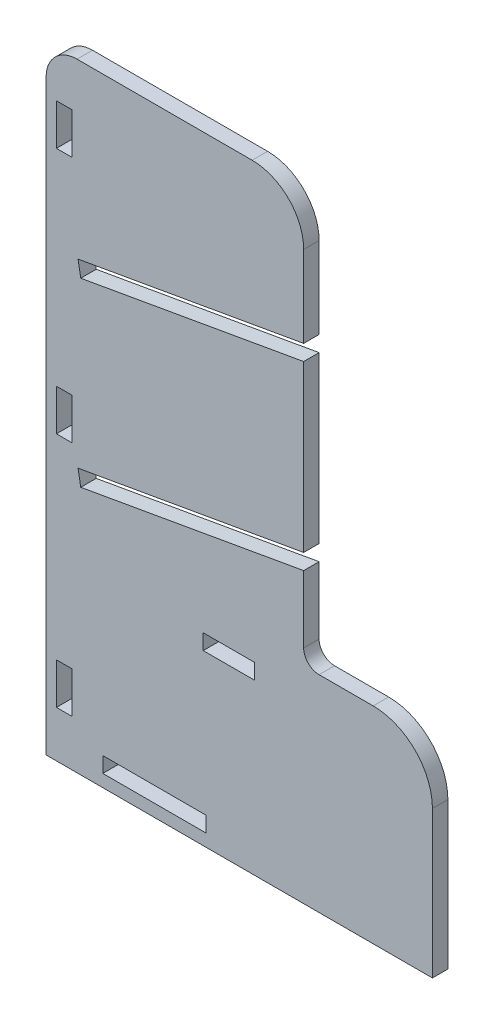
ISO-10303-21;
HEADER;
FILE_DESCRIPTION(('STEP AP214'),'2;1');
FILE_NAME('part.step','',(''),(''),'','','');
FILE_SCHEMA(('AUTOMOTIVE_DESIGN { 1 0 10303 214 1 1 1 1 }'));
ENDSEC;
DATA;
#1=APPLICATION_CONTEXT('core data for automotive mechanical design processes');
#2=APPLICATION_PROTOCOL_DEFINITION('international standard','automotive_design',2000,#1);
#3=PRODUCT_CONTEXT('',#1,'mechanical');
#4=PRODUCT('Part','Part','',(#3));
#5=PRODUCT_RELATED_PRODUCT_CATEGORY('part','',(#4));
#6=PRODUCT_DEFINITION_FORMATION('','',#4);
#7=PRODUCT_DEFINITION_CONTEXT('part definition',#1,'design');
#8=PRODUCT_DEFINITION('design','',#6,#7);
#9=PRODUCT_DEFINITION_SHAPE('','',#8);
#10=(LENGTH_UNIT() NAMED_UNIT(*) SI_UNIT(.MILLI.,.METRE.));
#11=(NAMED_UNIT(*) PLANE_ANGLE_UNIT() SI_UNIT($,.RADIAN.));
#12=(NAMED_UNIT(*) SI_UNIT($,.STERADIAN.) SOLID_ANGLE_UNIT());
#13=UNCERTAINTY_MEASURE_WITH_UNIT(LENGTH_MEASURE(1.E-05),#10,'distance_accuracy_value','');
#14=(GEOMETRIC_REPRESENTATION_CONTEXT(3) GLOBAL_UNCERTAINTY_ASSIGNED_CONTEXT((#13)) GLOBAL_UNIT_ASSIGNED_CONTEXT((#10,
#11,#12)) REPRESENTATION_CONTEXT('',''));
#15=CARTESIAN_POINT('',(0.,0.,0.));
#16=DIRECTION('',(0.,0.,1.));
#17=DIRECTION('',(1.,0.,0.));
#18=AXIS2_PLACEMENT_3D('',#15,#16,#17);
#19=CARTESIAN_POINT('',(125.,-85.,15.));
#20=DIRECTION('',(-1.,0.,0.));
#21=DIRECTION('',(0.,0.,1.));
#22=AXIS2_PLACEMENT_3D('',#19,#20,#21);
#23=PLANE('',#22);
#24=DIRECTION('',(0.,1.,0.));
#25=VECTOR('',#24,1.);
#26=CARTESIAN_POINT('',(125.,-85.,0.));
#27=LINE('',#26,#25);
#28=CARTESIAN_POINT('',(125.,-4.76860082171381,0.));
#29=VERTEX_POINT('',#28);
#30=CARTESIAN_POINT('',(125.,155.768600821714,0.));
#31=VERTEX_POINT('',#30);
#32=EDGE_CURVE('E512',#29,#31,#27,.T.);
#33=ORIENTED_EDGE('',*,*,#32,.T.);
#34=DIRECTION('',(0.,0.,1.));
#35=VECTOR('',#34,1.);
#36=CARTESIAN_POINT('',(125.,155.768600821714,-766.));
#37=LINE('',#36,#35);
#38=CARTESIAN_POINT('',(125.,155.768600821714,15.));
#39=VERTEX_POINT('',#38);
#40=EDGE_CURVE('E289',#31,#39,#37,.T.);
#41=ORIENTED_EDGE('',*,*,#40,.T.);
#42=DIRECTION('',(0.,1.,0.));
#43=VECTOR('',#42,1.);
#44=CARTESIAN_POINT('',(125.,-85.,15.));
#45=LINE('',#44,#43);
#46=CARTESIAN_POINT('',(125.,-4.76860082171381,15.));
#47=VERTEX_POINT('',#46);
#48=EDGE_CURVE('E488',#47,#39,#45,.T.);
#49=ORIENTED_EDGE('',*,*,#48,.F.);
#50=DIRECTION('',(0.,0.,1.));
#51=VECTOR('',#50,1.);
#52=CARTESIAN_POINT('',(125.,-4.76860082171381,-766.));
#53=LINE('',#52,#51);
#54=EDGE_CURVE('E283',#29,#47,#53,.T.);
#55=ORIENTED_EDGE('',*,*,#54,.F.);
#56=EDGE_LOOP('',(#33,#41,#49,#55));
#57=FACE_BOUND('',#56,.T.);
#58=ADVANCED_FACE('F37',(#57),#23,.F.);
#59=CARTESIAN_POINT('',(125.,-85.,0.));
#60=VERTEX_POINT('',#59);
#61=CARTESIAN_POINT('',(125.,-20.,0.));
#62=VERTEX_POINT('',#61);
#63=EDGE_CURVE('E508',#60,#62,#27,.T.);
#64=ORIENTED_EDGE('',*,*,#63,.T.);
#65=DIRECTION('',(0.,0.,1.));
#66=VECTOR('',#65,1.);
#67=CARTESIAN_POINT('',(125.,-20.,-766.));
#68=LINE('',#67,#66);
#69=CARTESIAN_POINT('',(125.,-20.,15.));
#70=VERTEX_POINT('',#69);
#71=EDGE_CURVE('E577',#62,#70,#68,.T.);
#72=ORIENTED_EDGE('',*,*,#71,.T.);
#73=CARTESIAN_POINT('',(125.,-85.,15.));
#74=VERTEX_POINT('',#73);
#75=EDGE_CURVE('E485',#74,#70,#45,.T.);
#76=ORIENTED_EDGE('',*,*,#75,.F.);
#77=DIRECTION('',(0.,0.,-1.));
#78=VECTOR('',#77,1.);
#79=CARTESIAN_POINT('',(125.,-85.,15.));
#80=LINE('',#79,#78);
#81=EDGE_CURVE('E533',#74,#60,#80,.T.);
#82=ORIENTED_EDGE('',*,*,#81,.T.);
#83=EDGE_LOOP('',(#64,#72,#76,#82));
#84=FACE_BOUND('',#83,.T.);
#85=ADVANCED_FACE('F581',(#84),#23,.F.);
#86=CARTESIAN_POINT('',(-125.,-300.,15.));
#87=DIRECTION('',(0.,1.,0.));
#88=DIRECTION('',(0.,0.,1.));
#89=AXIS2_PLACEMENT_3D('',#86,#87,#88);
#90=PLANE('',#89);
#91=DIRECTION('',(1.,0.,0.));
#92=VECTOR('',#91,1.);
#93=CARTESIAN_POINT('',(-125.,-300.,0.));
#94=LINE('',#93,#92);
#95=CARTESIAN_POINT('',(-125.,-300.,0.));
#96=VERTEX_POINT('',#95);
#97=CARTESIAN_POINT('',(250.,-300.,0.));
#98=VERTEX_POINT('',#97);
#99=EDGE_CURVE('E411',#96,#98,#94,.T.);
#100=ORIENTED_EDGE('',*,*,#99,.T.);
#101=DIRECTION('',(0.,0.,-1.));
#102=VECTOR('',#101,1.);
#103=CARTESIAN_POINT('',(250.,-300.,15.));
#104=LINE('',#103,#102);
#105=CARTESIAN_POINT('',(250.,-300.,15.));
#106=VERTEX_POINT('',#105);
#107=EDGE_CURVE('E545',#106,#98,#104,.T.);
#108=ORIENTED_EDGE('',*,*,#107,.F.);
#109=DIRECTION('',(1.,0.,0.));
#110=VECTOR('',#109,1.);
#111=CARTESIAN_POINT('',(-125.,-300.,15.));
#112=LINE('',#111,#110);
#113=CARTESIAN_POINT('',(-125.,-300.,15.));
#114=VERTEX_POINT('',#113);
#115=EDGE_CURVE('E472',#114,#106,#112,.T.);
#116=ORIENTED_EDGE('',*,*,#115,.F.);
#117=DIRECTION('',(0.,0.,-1.));
#118=VECTOR('',#117,1.);
#119=CARTESIAN_POINT('',(-125.,-300.,15.));
#120=LINE('',#119,#118);
#121=EDGE_CURVE('E496',#114,#96,#120,.T.);
#122=ORIENTED_EDGE('',*,*,#121,.T.);
#123=EDGE_LOOP('',(#100,#108,#116,#122));
#124=FACE_BOUND('',#123,.T.);
#125=ADVANCED_FACE('F39',(#124),#90,.F.);
#126=CARTESIAN_POINT('',(250.,-300.,15.));
#127=DIRECTION('',(-1.,0.,0.));
#128=DIRECTION('',(0.,-1.,0.));
#129=AXIS2_PLACEMENT_3D('',#126,#127,#128);
#130=PLANE('',#129);
#131=DIRECTION('',(0.,1.,0.));
#132=VECTOR('',#131,1.);
#133=CARTESIAN_POINT('',(250.,-300.,0.));
#134=LINE('',#133,#132);
#135=CARTESIAN_POINT('',(250.,-157.5,0.));
#136=VERTEX_POINT('',#135);
#137=EDGE_CURVE('E499',#98,#136,#134,.T.);
#138=ORIENTED_EDGE('',*,*,#137,.T.);
#139=DIRECTION('',(0.,0.,-1.));
#140=VECTOR('',#139,1.);
#141=CARTESIAN_POINT('',(250.,-157.5,15.));
#142=LINE('',#141,#140);
#143=CARTESIAN_POINT('',(250.,-157.5,15.));
#144=VERTEX_POINT('',#143);
#145=EDGE_CURVE('E542',#144,#136,#142,.T.);
#146=ORIENTED_EDGE('',*,*,#145,.F.);
#147=DIRECTION('',(0.,1.,0.));
#148=VECTOR('',#147,1.);
#149=CARTESIAN_POINT('',(250.,-300.,15.));
#150=LINE('',#149,#148);
#151=EDGE_CURVE('E475',#106,#144,#150,.T.);
#152=ORIENTED_EDGE('',*,*,#151,.F.);
#153=ORIENTED_EDGE('',*,*,#107,.T.);
#154=EDGE_LOOP('',(#138,#146,#152,#153));
#155=FACE_BOUND('',#154,.T.);
#156=ADVANCED_FACE('F987',(#155),#130,.F.);
#157=CARTESIAN_POINT('',(192.5,-157.5,15.));
#158=DIRECTION('',(0.,0.,-1.));
#159=DIRECTION('',(-1.,0.,0.));
#160=AXIS2_PLACEMENT_3D('',#157,#158,#159);
#161=CYLINDRICAL_SURFACE('',#160,57.5);
#162=CARTESIAN_POINT('',(192.5,-157.5,0.));
#163=DIRECTION('',(0.,0.,1.));
#164=DIRECTION('',(1.,0.,0.));
#165=AXIS2_PLACEMENT_3D('',#162,#163,#164);
#166=CIRCLE('',#165,57.5);
#167=CARTESIAN_POINT('',(192.5,-100.,0.));
#168=VERTEX_POINT('',#167);
#169=EDGE_CURVE('E501',#136,#168,#166,.T.);
#170=ORIENTED_EDGE('',*,*,#169,.T.);
#171=DIRECTION('',(0.,0.,-1.));
#172=VECTOR('',#171,1.);
#173=CARTESIAN_POINT('',(192.5,-100.,15.));
#174=LINE('',#173,#172);
#175=CARTESIAN_POINT('',(192.5,-100.,15.));
#176=VERTEX_POINT('',#175);
#177=EDGE_CURVE('E539',#176,#168,#174,.T.);
#178=ORIENTED_EDGE('',*,*,#177,.F.);
#179=CARTESIAN_POINT('',(192.5,-157.5,15.));
#180=DIRECTION('',(0.,0.,1.));
#181=DIRECTION('',(1.,0.,0.));
#182=AXIS2_PLACEMENT_3D('',#179,#180,#181);
#183=CIRCLE('',#182,57.5);
#184=EDGE_CURVE('E478',#144,#176,#183,.T.);
#185=ORIENTED_EDGE('',*,*,#184,.F.);
#186=ORIENTED_EDGE('',*,*,#145,.T.);
#187=EDGE_LOOP('',(#170,#178,#185,#186));
#188=FACE_BOUND('',#187,.T.);
#189=ADVANCED_FACE('F976',(#188),#161,.T.);
#190=CARTESIAN_POINT('',(192.5,-100.,15.));
#191=DIRECTION('',(0.,-1.,0.));
#192=DIRECTION('',(1.,0.,0.));
#193=AXIS2_PLACEMENT_3D('',#190,#191,#192);
#194=PLANE('',#193);
#195=DIRECTION('',(-1.,0.,0.));
#196=VECTOR('',#195,1.);
#197=CARTESIAN_POINT('',(192.5,-100.,0.));
#198=LINE('',#197,#196);
#199=CARTESIAN_POINT('',(140.,-100.,0.));
#200=VERTEX_POINT('',#199);
#201=EDGE_CURVE('E503',#168,#200,#198,.T.);
#202=ORIENTED_EDGE('',*,*,#201,.T.);
#203=DIRECTION('',(0.,0.,-1.));
#204=VECTOR('',#203,1.);
#205=CARTESIAN_POINT('',(140.,-100.,15.));
#206=LINE('',#205,#204);
#207=CARTESIAN_POINT('',(140.,-100.,15.));
#208=VERTEX_POINT('',#207);
#209=EDGE_CURVE('E536',#208,#200,#206,.T.);
#210=ORIENTED_EDGE('',*,*,#209,.F.);
#211=DIRECTION('',(-1.,0.,0.));
#212=VECTOR('',#211,1.);
#213=CARTESIAN_POINT('',(192.5,-100.,15.));
#214=LINE('',#213,#212);
#215=EDGE_CURVE('E480',#176,#208,#214,.T.);
#216=ORIENTED_EDGE('',*,*,#215,.F.);
#217=ORIENTED_EDGE('',*,*,#177,.T.);
#218=EDGE_LOOP('',(#202,#210,#216,#217));
#219=FACE_BOUND('',#218,.T.);
#220=ADVANCED_FACE('F623',(#219),#194,.F.);
#221=CARTESIAN_POINT('',(140.,-85.,15.));
#222=DIRECTION('',(0.,0.,-1.));
#223=DIRECTION('',(-1.,0.,0.));
#224=AXIS2_PLACEMENT_3D('',#221,#222,#223);
#225=CYLINDRICAL_SURFACE('',#224,15.);
#226=CARTESIAN_POINT('',(140.,-85.,0.));
#227=DIRECTION('',(0.,0.,-1.));
#228=DIRECTION('',(1.,0.,0.));
#229=AXIS2_PLACEMENT_3D('',#226,#227,#228);
#230=CIRCLE('',#229,15.);
#231=EDGE_CURVE('E505',#200,#60,#230,.T.);
#232=ORIENTED_EDGE('',*,*,#231,.T.);
#233=ORIENTED_EDGE('',*,*,#81,.F.);
#234=CARTESIAN_POINT('',(140.,-85.,15.));
#235=DIRECTION('',(0.,0.,-1.));
#236=DIRECTION('',(1.,0.,0.));
#237=AXIS2_PLACEMENT_3D('',#234,#235,#236);
#238=CIRCLE('',#237,15.);
#239=EDGE_CURVE('E482',#208,#74,#238,.T.);
#240=ORIENTED_EDGE('',*,*,#239,.F.);
#241=ORIENTED_EDGE('',*,*,#209,.T.);
#242=EDGE_LOOP('',(#232,#233,#240,#241));
#243=FACE_BOUND('',#242,.T.);
#244=ADVANCED_FACE('F589',(#243),#225,.F.);
#245=CARTESIAN_POINT('',(125.,171.,15.));
#246=VERTEX_POINT('',#245);
#247=CARTESIAN_POINT('',(125.,250.,15.));
#248=VERTEX_POINT('',#247);
#249=EDGE_CURVE('E484',#246,#248,#45,.T.);
#250=ORIENTED_EDGE('',*,*,#249,.F.);
#251=DIRECTION('',(0.,0.,1.));
#252=VECTOR('',#251,1.);
#253=CARTESIAN_POINT('',(125.,171.,-766.));
#254=LINE('',#253,#252);
#255=CARTESIAN_POINT('',(125.,171.,0.));
#256=VERTEX_POINT('',#255);
#257=EDGE_CURVE('E572',#256,#246,#254,.T.);
#258=ORIENTED_EDGE('',*,*,#257,.F.);
#259=CARTESIAN_POINT('',(125.,250.,0.));
#260=VERTEX_POINT('',#259);
#261=EDGE_CURVE('E507',#256,#260,#27,.T.);
#262=ORIENTED_EDGE('',*,*,#261,.T.);
#263=DIRECTION('',(0.,0.,-1.));
#264=VECTOR('',#263,1.);
#265=CARTESIAN_POINT('',(125.,250.,15.));
#266=LINE('',#265,#264);
#267=EDGE_CURVE('E530',#248,#260,#266,.T.);
#268=ORIENTED_EDGE('',*,*,#267,.F.);
#269=EDGE_LOOP('',(#250,#258,#262,#268));
#270=FACE_BOUND('',#269,.T.);
#271=ADVANCED_FACE('F608',(#270),#23,.F.);
#272=CARTESIAN_POINT('',(75.,250.,15.));
#273=DIRECTION('',(0.,0.,-1.));
#274=DIRECTION('',(-1.,0.,0.));
#275=AXIS2_PLACEMENT_3D('',#272,#273,#274);
#276=CYLINDRICAL_SURFACE('',#275,50.);
#277=CARTESIAN_POINT('',(75.,250.,0.));
#278=DIRECTION('',(0.,0.,1.));
#279=DIRECTION('',(1.,0.,0.));
#280=AXIS2_PLACEMENT_3D('',#277,#278,#279);
#281=CIRCLE('',#280,50.);
#282=CARTESIAN_POINT('',(75.,300.,0.));
#283=VERTEX_POINT('',#282);
#284=EDGE_CURVE('E511',#260,#283,#281,.T.);
#285=ORIENTED_EDGE('',*,*,#284,.T.);
#286=DIRECTION('',(0.,0.,-1.));
#287=VECTOR('',#286,1.);
#288=CARTESIAN_POINT('',(75.,300.,15.));
#289=LINE('',#288,#287);
#290=CARTESIAN_POINT('',(75.,300.,15.));
#291=VERTEX_POINT('',#290);
#292=EDGE_CURVE('E527',#291,#283,#289,.T.);
#293=ORIENTED_EDGE('',*,*,#292,.F.);
#294=CARTESIAN_POINT('',(75.,250.,15.));
#295=DIRECTION('',(0.,0.,1.));
#296=DIRECTION('',(1.,0.,0.));
#297=AXIS2_PLACEMENT_3D('',#294,#295,#296);
#298=CIRCLE('',#297,50.);
#299=EDGE_CURVE('E487',#248,#291,#298,.T.);
#300=ORIENTED_EDGE('',*,*,#299,.F.);
#301=ORIENTED_EDGE('',*,*,#267,.T.);
#302=EDGE_LOOP('',(#285,#293,#300,#301));
#303=FACE_BOUND('',#302,.T.);
#304=ADVANCED_FACE('F615',(#303),#276,.T.);
#305=CARTESIAN_POINT('',(75.,300.,15.));
#306=DIRECTION('',(0.,-1.,0.));
#307=DIRECTION('',(1.,0.,0.));
#308=AXIS2_PLACEMENT_3D('',#305,#306,#307);
#309=PLANE('',#308);
#310=DIRECTION('',(-1.,0.,0.));
#311=VECTOR('',#310,1.);
#312=CARTESIAN_POINT('',(75.,300.,0.));
#313=LINE('',#312,#311);
#314=CARTESIAN_POINT('',(-95.,300.,0.));
#315=VERTEX_POINT('',#314);
#316=EDGE_CURVE('E514',#283,#315,#313,.T.);
#317=ORIENTED_EDGE('',*,*,#316,.T.);
#318=DIRECTION('',(0.,0.,-1.));
#319=VECTOR('',#318,1.);
#320=CARTESIAN_POINT('',(-95.,300.,15.));
#321=LINE('',#320,#319);
#322=CARTESIAN_POINT('',(-95.,300.,15.));
#323=VERTEX_POINT('',#322);
#324=EDGE_CURVE('E524',#323,#315,#321,.T.);
#325=ORIENTED_EDGE('',*,*,#324,.F.);
#326=DIRECTION('',(-1.,0.,0.));
#327=VECTOR('',#326,1.);
#328=CARTESIAN_POINT('',(75.,300.,15.));
#329=LINE('',#328,#327);
#330=EDGE_CURVE('E490',#291,#323,#329,.T.);
#331=ORIENTED_EDGE('',*,*,#330,.F.);
#332=ORIENTED_EDGE('',*,*,#292,.T.);
#333=EDGE_LOOP('',(#317,#325,#331,#332));
#334=FACE_BOUND('',#333,.T.);
#335=ADVANCED_FACE('F621',(#334),#309,.F.);
#336=CARTESIAN_POINT('',(-95.,270.,15.));
#337=DIRECTION('',(0.,0.,-1.));
#338=DIRECTION('',(-1.,0.,0.));
#339=AXIS2_PLACEMENT_3D('',#336,#337,#338);
#340=CYLINDRICAL_SURFACE('',#339,30.);
#341=CARTESIAN_POINT('',(-95.,270.,0.));
#342=DIRECTION('',(0.,0.,1.));
#343=DIRECTION('',(-1.,0.,0.));
#344=AXIS2_PLACEMENT_3D('',#341,#342,#343);
#345=CIRCLE('',#344,30.);
#346=CARTESIAN_POINT('',(-125.,270.,0.));
#347=VERTEX_POINT('',#346);
#348=EDGE_CURVE('E516',#315,#347,#345,.T.);
#349=ORIENTED_EDGE('',*,*,#348,.T.);
#350=DIRECTION('',(0.,0.,-1.));
#351=VECTOR('',#350,1.);
#352=CARTESIAN_POINT('',(-125.,270.,15.));
#353=LINE('',#352,#351);
#354=CARTESIAN_POINT('',(-125.,270.,15.));
#355=VERTEX_POINT('',#354);
#356=EDGE_CURVE('E521',#355,#347,#353,.T.);
#357=ORIENTED_EDGE('',*,*,#356,.F.);
#358=CARTESIAN_POINT('',(-95.,270.,15.));
#359=DIRECTION('',(0.,0.,1.));
#360=DIRECTION('',(-1.,0.,0.));
#361=AXIS2_PLACEMENT_3D('',#358,#359,#360);
#362=CIRCLE('',#361,30.);
#363=EDGE_CURVE('E492',#323,#355,#362,.T.);
#364=ORIENTED_EDGE('',*,*,#363,.F.);
#365=ORIENTED_EDGE('',*,*,#324,.T.);
#366=EDGE_LOOP('',(#349,#357,#364,#365));
#367=FACE_BOUND('',#366,.T.);
#368=ADVANCED_FACE('F933',(#367),#340,.T.);
#369=CARTESIAN_POINT('',(-125.,270.,15.));
#370=DIRECTION('',(1.,0.,0.));
#371=DIRECTION('',(0.,1.,0.));
#372=AXIS2_PLACEMENT_3D('',#369,#370,#371);
#373=PLANE('',#372);
#374=DIRECTION('',(0.,-1.,0.));
#375=VECTOR('',#374,1.);
#376=CARTESIAN_POINT('',(-125.,270.,0.));
#377=LINE('',#376,#375);
#378=EDGE_CURVE('E476',#347,#96,#377,.T.);
#379=ORIENTED_EDGE('',*,*,#378,.T.);
#380=ORIENTED_EDGE('',*,*,#121,.F.);
#381=DIRECTION('',(0.,-1.,0.));
#382=VECTOR('',#381,1.);
#383=CARTESIAN_POINT('',(-125.,270.,15.));
#384=LINE('',#383,#382);
#385=EDGE_CURVE('E494',#355,#114,#384,.T.);
#386=ORIENTED_EDGE('',*,*,#385,.F.);
#387=ORIENTED_EDGE('',*,*,#356,.T.);
#388=EDGE_LOOP('',(#379,#380,#386,#387));
#389=FACE_BOUND('',#388,.T.);
#390=ADVANCED_FACE('F694',(#389),#373,.F.);
#391=CARTESIAN_POINT('',(192.5,-157.5,15.));
#392=DIRECTION('',(0.,0.,1.));
#393=DIRECTION('',(1.,0.,0.));
#394=AXIS2_PLACEMENT_3D('',#391,#392,#393);
#395=PLANE('',#394);
#396=DIRECTION('',(0.984807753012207,0.173648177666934,0.));
#397=VECTOR('',#396,1.);
#398=CARTESIAN_POINT('',(136.892540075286,157.865576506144,15.));
#399=LINE('',#398,#397);
#400=CARTESIAN_POINT('',(-91.395277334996,117.612274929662,15.));
#401=VERTEX_POINT('',#400);
#402=EDGE_CURVE('E314',#401,#39,#399,.T.);
#403=ORIENTED_EDGE('',*,*,#402,.F.);
#404=DIRECTION('',(0.173648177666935,-0.984807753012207,0.));
#405=VECTOR('',#404,1.);
#406=CARTESIAN_POINT('',(-35.7878174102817,-197.753301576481,15.));
#407=LINE('',#406,#405);
#408=CARTESIAN_POINT('',(-94.,132.384391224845,15.));
#409=VERTEX_POINT('',#408);
#410=EDGE_CURVE('E312',#409,#401,#407,.T.);
#411=ORIENTED_EDGE('',*,*,#410,.F.);
#412=DIRECTION('',(-0.984807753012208,-0.173648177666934,0.));
#413=VECTOR('',#412,1.);
#414=CARTESIAN_POINT('',(134.287817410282,172.637692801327,15.));
#415=LINE('',#414,#413);
#416=EDGE_CURVE('E307',#246,#409,#415,.T.);
#417=ORIENTED_EDGE('',*,*,#416,.F.);
#418=ORIENTED_EDGE('',*,*,#249,.T.);
#419=ORIENTED_EDGE('',*,*,#299,.T.);
#420=ORIENTED_EDGE('',*,*,#330,.T.);
#421=ORIENTED_EDGE('',*,*,#363,.T.);
#422=ORIENTED_EDGE('',*,*,#385,.T.);
#423=ORIENTED_EDGE('',*,*,#115,.T.);
#424=ORIENTED_EDGE('',*,*,#151,.T.);
#425=ORIENTED_EDGE('',*,*,#184,.T.);
#426=ORIENTED_EDGE('',*,*,#215,.T.);
#427=ORIENTED_EDGE('',*,*,#239,.T.);
#428=ORIENTED_EDGE('',*,*,#75,.T.);
#429=DIRECTION('',(0.984807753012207,0.173648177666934,0.));
#430=VECTOR('',#429,1.);
#431=CARTESIAN_POINT('',(166.950741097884,-12.6029524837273,15.));
#432=LINE('',#431,#430);
#433=CARTESIAN_POINT('',(-91.395277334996,-58.1563258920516,15.));
#434=VERTEX_POINT('',#433);
#435=EDGE_CURVE('E305',#434,#70,#432,.T.);
#436=ORIENTED_EDGE('',*,*,#435,.F.);
#437=DIRECTION('',(0.173648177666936,-0.984807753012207,0.));
#438=VECTOR('',#437,1.);
#439=CARTESIAN_POINT('',(-65.8460184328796,-203.053373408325,15.));
#440=LINE('',#439,#438);
#441=CARTESIAN_POINT('',(-94.,-43.3842095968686,15.));
#442=VERTEX_POINT('',#441);
#443=EDGE_CURVE('E288',#442,#434,#440,.T.);
#444=ORIENTED_EDGE('',*,*,#443,.F.);
#445=DIRECTION('',(-0.984807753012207,-0.173648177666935,0.));
#446=VECTOR('',#445,1.);
#447=CARTESIAN_POINT('',(164.34601843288,2.16916381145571,15.));
#448=LINE('',#447,#446);
#449=EDGE_CURVE('E280',#47,#442,#448,.T.);
#450=ORIENTED_EDGE('',*,*,#449,.F.);
#451=ORIENTED_EDGE('',*,*,#48,.T.);
#452=EDGE_LOOP('',(#403,#411,#417,#418,#419,#420,#421,#422,#423,#424,#425,#426,#427,#428,#436,
#444,#450,#451));
#453=FACE_BOUND('',#452,.T.);
#454=DIRECTION('',(0.,-1.,0.));
#455=VECTOR('',#454,1.);
#456=CARTESIAN_POINT('',(-70.,-273.,15.));
#457=LINE('',#456,#455);
#458=CARTESIAN_POINT('',(-70.,-273.,15.));
#459=VERTEX_POINT('',#458);
#460=CARTESIAN_POINT('',(-70.,-288.,15.));
#461=VERTEX_POINT('',#460);
#462=EDGE_CURVE('E324',#459,#461,#457,.T.);
#463=ORIENTED_EDGE('',*,*,#462,.F.);
#464=DIRECTION('',(-1.,0.,0.));
#465=VECTOR('',#464,1.);
#466=CARTESIAN_POINT('',(-70.,-273.,15.));
#467=LINE('',#466,#465);
#468=CARTESIAN_POINT('',(30.,-273.,15.));
#469=VERTEX_POINT('',#468);
#470=EDGE_CURVE('E332',#469,#459,#467,.T.);
#471=ORIENTED_EDGE('',*,*,#470,.F.);
#472=DIRECTION('',(0.,1.,0.));
#473=VECTOR('',#472,1.);
#474=CARTESIAN_POINT('',(30.,-273.,15.));
#475=LINE('',#474,#473);
#476=CARTESIAN_POINT('',(30.,-288.,15.));
#477=VERTEX_POINT('',#476);
#478=EDGE_CURVE('E329',#477,#469,#475,.T.);
#479=ORIENTED_EDGE('',*,*,#478,.F.);
#480=DIRECTION('',(1.,0.,0.));
#481=VECTOR('',#480,1.);
#482=CARTESIAN_POINT('',(-70.,-288.,15.));
#483=LINE('',#482,#481);
#484=EDGE_CURVE('E326',#461,#477,#483,.T.);
#485=ORIENTED_EDGE('',*,*,#484,.F.);
#486=EDGE_LOOP('',(#463,#471,#479,#485));
#487=FACE_BOUND('',#486,.T.);
#488=DIRECTION('',(0.,-1.,0.));
#489=VECTOR('',#488,1.);
#490=CARTESIAN_POINT('',(27.5,-121.,15.));
#491=LINE('',#490,#489);
#492=CARTESIAN_POINT('',(27.5,-121.,15.));
#493=VERTEX_POINT('',#492);
#494=CARTESIAN_POINT('',(27.5,-136.,15.));
#495=VERTEX_POINT('',#494);
#496=EDGE_CURVE('E355',#493,#495,#491,.T.);
#497=ORIENTED_EDGE('',*,*,#496,.F.);
#498=DIRECTION('',(-1.,0.,0.));
#499=VECTOR('',#498,1.);
#500=CARTESIAN_POINT('',(27.5,-121.,15.));
#501=LINE('',#500,#499);
#502=CARTESIAN_POINT('',(77.5,-121.,15.));
#503=VERTEX_POINT('',#502);
#504=EDGE_CURVE('E363',#503,#493,#501,.T.);
#505=ORIENTED_EDGE('',*,*,#504,.F.);
#506=DIRECTION('',(0.,1.,0.));
#507=VECTOR('',#506,1.);
#508=CARTESIAN_POINT('',(77.5,-121.,15.));
#509=LINE('',#508,#507);
#510=CARTESIAN_POINT('',(77.5,-136.,15.));
#511=VERTEX_POINT('',#510);
#512=EDGE_CURVE('E360',#511,#503,#509,.T.);
#513=ORIENTED_EDGE('',*,*,#512,.F.);
#514=DIRECTION('',(1.,0.,0.));
#515=VECTOR('',#514,1.);
#516=CARTESIAN_POINT('',(27.5,-136.,15.));
#517=LINE('',#516,#515);
#518=EDGE_CURVE('E357',#495,#511,#517,.T.);
#519=ORIENTED_EDGE('',*,*,#518,.F.);
#520=EDGE_LOOP('',(#497,#505,#513,#519));
#521=FACE_BOUND('',#520,.T.);
#522=DIRECTION('',(0.,-1.,0.));
#523=VECTOR('',#522,1.);
#524=CARTESIAN_POINT('',(-115.,255.,15.));
#525=LINE('',#524,#523);
#526=CARTESIAN_POINT('',(-115.,255.,15.));
#527=VERTEX_POINT('',#526);
#528=CARTESIAN_POINT('',(-115.,215.,15.));
#529=VERTEX_POINT('',#528);
#530=EDGE_CURVE('E388',#527,#529,#525,.T.);
#531=ORIENTED_EDGE('',*,*,#530,.F.);
#532=DIRECTION('',(-1.,0.,0.));
#533=VECTOR('',#532,1.);
#534=CARTESIAN_POINT('',(-115.,255.,15.));
#535=LINE('',#534,#533);
#536=CARTESIAN_POINT('',(-100.,255.,15.));
#537=VERTEX_POINT('',#536);
#538=EDGE_CURVE('E396',#537,#527,#535,.T.);
#539=ORIENTED_EDGE('',*,*,#538,.F.);
#540=DIRECTION('',(0.,1.,0.));
#541=VECTOR('',#540,1.);
#542=CARTESIAN_POINT('',(-100.,255.,15.));
#543=LINE('',#542,#541);
#544=CARTESIAN_POINT('',(-100.,215.,15.));
#545=VERTEX_POINT('',#544);
#546=EDGE_CURVE('E393',#545,#537,#543,.T.);
#547=ORIENTED_EDGE('',*,*,#546,.F.);
#548=DIRECTION('',(1.,0.,0.));
#549=VECTOR('',#548,1.);
#550=CARTESIAN_POINT('',(-115.,215.,15.));
#551=LINE('',#550,#549);
#552=EDGE_CURVE('E390',#529,#545,#551,.T.);
#553=ORIENTED_EDGE('',*,*,#552,.F.);
#554=EDGE_LOOP('',(#531,#539,#547,#553));
#555=FACE_BOUND('',#554,.T.);
#556=DIRECTION('',(0.,-1.,0.));
#557=VECTOR('',#556,1.);
#558=CARTESIAN_POINT('',(-115.,-215.,15.));
#559=LINE('',#558,#557);
#560=CARTESIAN_POINT('',(-115.,-215.,15.));
#561=VERTEX_POINT('',#560);
#562=CARTESIAN_POINT('',(-115.,-255.,15.));
#563=VERTEX_POINT('',#562);
#564=EDGE_CURVE('E434',#561,#563,#559,.T.);
#565=ORIENTED_EDGE('',*,*,#564,.F.);
#566=DIRECTION('',(-1.,0.,0.));
#567=VECTOR('',#566,1.);
#568=CARTESIAN_POINT('',(-115.,-215.,15.));
#569=LINE('',#568,#567);
#570=CARTESIAN_POINT('',(-100.,-215.,15.));
#571=VERTEX_POINT('',#570);
#572=EDGE_CURVE('E420',#571,#561,#569,.T.);
#573=ORIENTED_EDGE('',*,*,#572,.F.);
#574=DIRECTION('',(0.,1.,0.));
#575=VECTOR('',#574,1.);
#576=CARTESIAN_POINT('',(-100.,-215.,15.));
#577=LINE('',#576,#575);
#578=CARTESIAN_POINT('',(-100.,-255.,15.));
#579=VERTEX_POINT('',#578);
#580=EDGE_CURVE('E428',#579,#571,#577,.T.);
#581=ORIENTED_EDGE('',*,*,#580,.F.);
#582=DIRECTION('',(1.,0.,0.));
#583=VECTOR('',#582,1.);
#584=CARTESIAN_POINT('',(-115.,-255.,15.));
#585=LINE('',#584,#583);
#586=EDGE_CURVE('E431',#563,#579,#585,.T.);
#587=ORIENTED_EDGE('',*,*,#586,.F.);
#588=EDGE_LOOP('',(#565,#573,#581,#587));
#589=FACE_BOUND('',#588,.T.);
#590=DIRECTION('',(0.,-1.,0.));
#591=VECTOR('',#590,1.);
#592=CARTESIAN_POINT('',(-115.,-25.,15.));
#593=LINE('',#592,#591);
#594=CARTESIAN_POINT('',(-115.,15.,15.));
#595=VERTEX_POINT('',#594);
#596=CARTESIAN_POINT('',(-115.,-25.,15.));
#597=VERTEX_POINT('',#596);
#598=EDGE_CURVE('E463',#595,#597,#593,.T.);
#599=ORIENTED_EDGE('',*,*,#598,.F.);
#600=DIRECTION('',(-1.,0.,0.));
#601=VECTOR('',#600,1.);
#602=CARTESIAN_POINT('',(-115.,15.,15.));
#603=LINE('',#602,#601);
#604=CARTESIAN_POINT('',(-100.,15.,15.));
#605=VERTEX_POINT('',#604);
#606=EDGE_CURVE('E449',#605,#595,#603,.T.);
#607=ORIENTED_EDGE('',*,*,#606,.F.);
#608=DIRECTION('',(0.,1.,0.));
#609=VECTOR('',#608,1.);
#610=CARTESIAN_POINT('',(-100.,-25.,15.));
#611=LINE('',#610,#609);
#612=CARTESIAN_POINT('',(-100.,-25.,15.));
#613=VERTEX_POINT('',#612);
#614=EDGE_CURVE('E457',#613,#605,#611,.T.);
#615=ORIENTED_EDGE('',*,*,#614,.F.);
#616=DIRECTION('',(1.,0.,0.));
#617=VECTOR('',#616,1.);
#618=CARTESIAN_POINT('',(-115.,-25.,15.));
#619=LINE('',#618,#617);
#620=EDGE_CURVE('E460',#597,#613,#619,.T.);
#621=ORIENTED_EDGE('',*,*,#620,.F.);
#622=EDGE_LOOP('',(#599,#607,#615,#621));
#623=FACE_BOUND('',#622,.T.);
#624=ADVANCED_FACE('F302',(#453,#487,#521,#555,#589,#623),#395,.T.);
#625=CARTESIAN_POINT('',(192.5,-157.5,0.));
#626=DIRECTION('',(0.,0.,1.));
#627=DIRECTION('',(1.,0.,0.));
#628=AXIS2_PLACEMENT_3D('',#625,#626,#627);
#629=PLANE('',#628);
#630=DIRECTION('',(1.,0.,0.));
#631=VECTOR('',#630,1.);
#632=CARTESIAN_POINT('',(-70.,-273.,0.));
#633=LINE('',#632,#631);
#634=CARTESIAN_POINT('',(-70.,-273.,0.));
#635=VERTEX_POINT('',#634);
#636=CARTESIAN_POINT('',(30.,-273.,0.));
#637=VERTEX_POINT('',#636);
#638=EDGE_CURVE('E318',#635,#637,#633,.T.);
#639=ORIENTED_EDGE('',*,*,#638,.F.);
#640=DIRECTION('',(0.,1.,0.));
#641=VECTOR('',#640,1.);
#642=CARTESIAN_POINT('',(-70.,-273.,0.));
#643=LINE('',#642,#641);
#644=CARTESIAN_POINT('',(-70.,-288.,0.));
#645=VERTEX_POINT('',#644);
#646=EDGE_CURVE('E321',#645,#635,#643,.T.);
#647=ORIENTED_EDGE('',*,*,#646,.F.);
#648=DIRECTION('',(-1.,0.,0.));
#649=VECTOR('',#648,1.);
#650=CARTESIAN_POINT('',(-70.,-288.,0.));
#651=LINE('',#650,#649);
#652=CARTESIAN_POINT('',(30.,-288.,0.));
#653=VERTEX_POINT('',#652);
#654=EDGE_CURVE('E338',#653,#645,#651,.T.);
#655=ORIENTED_EDGE('',*,*,#654,.F.);
#656=DIRECTION('',(0.,-1.,0.));
#657=VECTOR('',#656,1.);
#658=CARTESIAN_POINT('',(30.,-273.,0.));
#659=LINE('',#658,#657);
#660=EDGE_CURVE('E316',#637,#653,#659,.T.);
#661=ORIENTED_EDGE('',*,*,#660,.F.);
#662=EDGE_LOOP('',(#639,#647,#655,#661));
#663=FACE_BOUND('',#662,.T.);
#664=DIRECTION('',(1.,0.,0.));
#665=VECTOR('',#664,1.);
#666=CARTESIAN_POINT('',(27.5,-121.,0.));
#667=LINE('',#666,#665);
#668=CARTESIAN_POINT('',(27.5,-121.,0.));
#669=VERTEX_POINT('',#668);
#670=CARTESIAN_POINT('',(77.5,-121.,0.));
#671=VERTEX_POINT('',#670);
#672=EDGE_CURVE('E349',#669,#671,#667,.T.);
#673=ORIENTED_EDGE('',*,*,#672,.F.);
#674=DIRECTION('',(0.,1.,0.));
#675=VECTOR('',#674,1.);
#676=CARTESIAN_POINT('',(27.5,-121.,0.));
#677=LINE('',#676,#675);
#678=CARTESIAN_POINT('',(27.5,-136.,0.));
#679=VERTEX_POINT('',#678);
#680=EDGE_CURVE('E352',#679,#669,#677,.T.);
#681=ORIENTED_EDGE('',*,*,#680,.F.);
#682=DIRECTION('',(-1.,0.,0.));
#683=VECTOR('',#682,1.);
#684=CARTESIAN_POINT('',(27.5,-136.,0.));
#685=LINE('',#684,#683);
#686=CARTESIAN_POINT('',(77.5,-136.,0.));
#687=VERTEX_POINT('',#686);
#688=EDGE_CURVE('E369',#687,#679,#685,.T.);
#689=ORIENTED_EDGE('',*,*,#688,.F.);
#690=DIRECTION('',(0.,-1.,0.));
#691=VECTOR('',#690,1.);
#692=CARTESIAN_POINT('',(77.5,-121.,0.));
#693=LINE('',#692,#691);
#694=EDGE_CURVE('E347',#671,#687,#693,.T.);
#695=ORIENTED_EDGE('',*,*,#694,.F.);
#696=EDGE_LOOP('',(#673,#681,#689,#695));
#697=FACE_BOUND('',#696,.T.);
#698=DIRECTION('',(1.,0.,0.));
#699=VECTOR('',#698,1.);
#700=CARTESIAN_POINT('',(-115.,255.,0.));
#701=LINE('',#700,#699);
#702=CARTESIAN_POINT('',(-115.,255.,0.));
#703=VERTEX_POINT('',#702);
#704=CARTESIAN_POINT('',(-100.,255.,0.));
#705=VERTEX_POINT('',#704);
#706=EDGE_CURVE('E381',#703,#705,#701,.T.);
#707=ORIENTED_EDGE('',*,*,#706,.F.);
#708=DIRECTION('',(0.,1.,0.));
#709=VECTOR('',#708,1.);
#710=CARTESIAN_POINT('',(-115.,255.,0.));
#711=LINE('',#710,#709);
#712=CARTESIAN_POINT('',(-115.,215.,0.));
#713=VERTEX_POINT('',#712);
#714=EDGE_CURVE('E385',#713,#703,#711,.T.);
#715=ORIENTED_EDGE('',*,*,#714,.F.);
#716=DIRECTION('',(-1.,0.,0.));
#717=VECTOR('',#716,1.);
#718=CARTESIAN_POINT('',(-115.,215.,0.));
#719=LINE('',#718,#717);
#720=CARTESIAN_POINT('',(-100.,215.,0.));
#721=VERTEX_POINT('',#720);
#722=EDGE_CURVE('E402',#721,#713,#719,.T.);
#723=ORIENTED_EDGE('',*,*,#722,.F.);
#724=DIRECTION('',(0.,-1.,0.));
#725=VECTOR('',#724,1.);
#726=CARTESIAN_POINT('',(-100.,255.,0.));
#727=LINE('',#726,#725);
#728=EDGE_CURVE('E379',#705,#721,#727,.T.);
#729=ORIENTED_EDGE('',*,*,#728,.F.);
#730=EDGE_LOOP('',(#707,#715,#723,#729));
#731=FACE_BOUND('',#730,.T.);
#732=DIRECTION('',(1.,0.,0.));
#733=VECTOR('',#732,1.);
#734=CARTESIAN_POINT('',(-115.,-215.,0.));
#735=LINE('',#734,#733);
#736=CARTESIAN_POINT('',(-115.,-215.,0.));
#737=VERTEX_POINT('',#736);
#738=CARTESIAN_POINT('',(-100.,-215.,0.));
#739=VERTEX_POINT('',#738);
#740=EDGE_CURVE('E439',#737,#739,#735,.T.);
#741=ORIENTED_EDGE('',*,*,#740,.F.);
#742=DIRECTION('',(0.,1.,0.));
#743=VECTOR('',#742,1.);
#744=CARTESIAN_POINT('',(-115.,-215.,0.));
#745=LINE('',#744,#743);
#746=CARTESIAN_POINT('',(-115.,-255.,0.));
#747=VERTEX_POINT('',#746);
#748=EDGE_CURVE('E436',#747,#737,#745,.T.);
#749=ORIENTED_EDGE('',*,*,#748,.F.);
#750=DIRECTION('',(-1.,0.,0.));
#751=VECTOR('',#750,1.);
#752=CARTESIAN_POINT('',(-115.,-255.,0.));
#753=LINE('',#752,#751);
#754=CARTESIAN_POINT('',(-100.,-255.,0.));
#755=VERTEX_POINT('',#754);
#756=EDGE_CURVE('E412',#755,#747,#753,.T.);
#757=ORIENTED_EDGE('',*,*,#756,.F.);
#758=DIRECTION('',(0.,-1.,0.));
#759=VECTOR('',#758,1.);
#760=CARTESIAN_POINT('',(-100.,-215.,0.));
#761=LINE('',#760,#759);
#762=EDGE_CURVE('E382',#739,#755,#761,.T.);
#763=ORIENTED_EDGE('',*,*,#762,.F.);
#764=EDGE_LOOP('',(#741,#749,#757,#763));
#765=FACE_BOUND('',#764,.T.);
#766=DIRECTION('',(1.,0.,0.));
#767=VECTOR('',#766,1.);
#768=CARTESIAN_POINT('',(-115.,15.,0.));
#769=LINE('',#768,#767);
#770=CARTESIAN_POINT('',(-115.,15.,0.));
#771=VERTEX_POINT('',#770);
#772=CARTESIAN_POINT('',(-100.,15.,0.));
#773=VERTEX_POINT('',#772);
#774=EDGE_CURVE('E468',#771,#773,#769,.T.);
#775=ORIENTED_EDGE('',*,*,#774,.F.);
#776=DIRECTION('',(0.,1.,0.));
#777=VECTOR('',#776,1.);
#778=CARTESIAN_POINT('',(-115.,-25.,0.));
#779=LINE('',#778,#777);
#780=CARTESIAN_POINT('',(-115.,-25.,0.));
#781=VERTEX_POINT('',#780);
#782=EDGE_CURVE('E465',#781,#771,#779,.T.);
#783=ORIENTED_EDGE('',*,*,#782,.F.);
#784=DIRECTION('',(-1.,0.,0.));
#785=VECTOR('',#784,1.);
#786=CARTESIAN_POINT('',(-115.,-25.,0.));
#787=LINE('',#786,#785);
#788=CARTESIAN_POINT('',(-100.,-25.,0.));
#789=VERTEX_POINT('',#788);
#790=EDGE_CURVE('E378',#789,#781,#787,.T.);
#791=ORIENTED_EDGE('',*,*,#790,.F.);
#792=DIRECTION('',(0.,-1.,0.));
#793=VECTOR('',#792,1.);
#794=CARTESIAN_POINT('',(-100.,-25.,0.));
#795=LINE('',#794,#793);
#796=EDGE_CURVE('E416',#773,#789,#795,.T.);
#797=ORIENTED_EDGE('',*,*,#796,.F.);
#798=EDGE_LOOP('',(#775,#783,#791,#797));
#799=FACE_BOUND('',#798,.T.);
#800=DIRECTION('',(0.173648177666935,-0.984807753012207,0.));
#801=VECTOR('',#800,1.);
#802=CARTESIAN_POINT('',(-35.7878174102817,-197.753301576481,0.));
#803=LINE('',#802,#801);
#804=CARTESIAN_POINT('',(-94.,132.384391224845,0.));
#805=VERTEX_POINT('',#804);
#806=CARTESIAN_POINT('',(-91.395277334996,117.612274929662,0.));
#807=VERTEX_POINT('',#806);
#808=EDGE_CURVE('E45',#805,#807,#803,.T.);
#809=ORIENTED_EDGE('',*,*,#808,.T.);
#810=DIRECTION('',(0.984807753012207,0.173648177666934,0.));
#811=VECTOR('',#810,1.);
#812=CARTESIAN_POINT('',(136.892540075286,157.865576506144,0.));
#813=LINE('',#812,#811);
#814=EDGE_CURVE('E11',#807,#31,#813,.T.);
#815=ORIENTED_EDGE('',*,*,#814,.T.);
#816=ORIENTED_EDGE('',*,*,#32,.F.);
#817=DIRECTION('',(-0.984807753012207,-0.173648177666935,0.));
#818=VECTOR('',#817,1.);
#819=CARTESIAN_POINT('',(164.34601843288,2.16916381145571,0.));
#820=LINE('',#819,#818);
#821=CARTESIAN_POINT('',(-93.9999999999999,-43.3842095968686,0.));
#822=VERTEX_POINT('',#821);
#823=EDGE_CURVE('E548',#29,#822,#820,.T.);
#824=ORIENTED_EDGE('',*,*,#823,.T.);
#825=DIRECTION('',(0.173648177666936,-0.984807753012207,0.));
#826=VECTOR('',#825,1.);
#827=CARTESIAN_POINT('',(-65.8460184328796,-203.053373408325,0.));
#828=LINE('',#827,#826);
#829=CARTESIAN_POINT('',(-91.395277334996,-58.1563258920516,0.));
#830=VERTEX_POINT('',#829);
#831=EDGE_CURVE('E296',#822,#830,#828,.T.);
#832=ORIENTED_EDGE('',*,*,#831,.T.);
#833=DIRECTION('',(0.984807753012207,0.173648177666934,0.));
#834=VECTOR('',#833,1.);
#835=CARTESIAN_POINT('',(166.950741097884,-12.6029524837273,0.));
#836=LINE('',#835,#834);
#837=EDGE_CURVE('E551',#830,#62,#836,.T.);
#838=ORIENTED_EDGE('',*,*,#837,.T.);
#839=ORIENTED_EDGE('',*,*,#63,.F.);
#840=ORIENTED_EDGE('',*,*,#231,.F.);
#841=ORIENTED_EDGE('',*,*,#201,.F.);
#842=ORIENTED_EDGE('',*,*,#169,.F.);
#843=ORIENTED_EDGE('',*,*,#137,.F.);
#844=ORIENTED_EDGE('',*,*,#99,.F.);
#845=ORIENTED_EDGE('',*,*,#378,.F.);
#846=ORIENTED_EDGE('',*,*,#348,.F.);
#847=ORIENTED_EDGE('',*,*,#316,.F.);
#848=ORIENTED_EDGE('',*,*,#284,.F.);
#849=ORIENTED_EDGE('',*,*,#261,.F.);
#850=DIRECTION('',(-0.984807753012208,-0.173648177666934,0.));
#851=VECTOR('',#850,1.);
#852=CARTESIAN_POINT('',(134.287817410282,172.637692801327,0.));
#853=LINE('',#852,#851);
#854=EDGE_CURVE('E554',#256,#805,#853,.T.);
#855=ORIENTED_EDGE('',*,*,#854,.T.);
#856=EDGE_LOOP('',(#809,#815,#816,#824,#832,#838,#839,#840,#841,#842,#843,#844,#845,#846,#847,
#848,#849,#855));
#857=FACE_BOUND('',#856,.T.);
#858=ADVANCED_FACE('F558',(#663,#697,#731,#765,#799,#857),#629,.F.);
#859=CARTESIAN_POINT('',(-115.,-25.,-0.000999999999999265));
#860=DIRECTION('',(-1.,0.,0.));
#861=DIRECTION('',(0.,0.,1.));
#862=AXIS2_PLACEMENT_3D('',#859,#860,#861);
#863=PLANE('',#862);
#864=ORIENTED_EDGE('',*,*,#782,.T.);
#865=DIRECTION('',(0.,0.,1.));
#866=VECTOR('',#865,1.);
#867=CARTESIAN_POINT('',(-115.,15.,-0.000999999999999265));
#868=LINE('',#867,#866);
#869=EDGE_CURVE('E445',#771,#595,#868,.T.);
#870=ORIENTED_EDGE('',*,*,#869,.T.);
#871=ORIENTED_EDGE('',*,*,#598,.T.);
#872=DIRECTION('',(0.,0.,1.));
#873=VECTOR('',#872,1.);
#874=CARTESIAN_POINT('',(-115.,-25.,-0.000999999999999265));
#875=LINE('',#874,#873);
#876=EDGE_CURVE('E446',#781,#597,#875,.T.);
#877=ORIENTED_EDGE('',*,*,#876,.F.);
#878=EDGE_LOOP('',(#864,#870,#871,#877));
#879=FACE_BOUND('',#878,.T.);
#880=ADVANCED_FACE('F682',(#879),#863,.F.);
#881=CARTESIAN_POINT('',(-115.,15.,-0.000999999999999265));
#882=DIRECTION('',(0.,1.,0.));
#883=DIRECTION('',(0.,0.,1.));
#884=AXIS2_PLACEMENT_3D('',#881,#882,#883);
#885=PLANE('',#884);
#886=ORIENTED_EDGE('',*,*,#774,.T.);
#887=DIRECTION('',(0.,0.,1.));
#888=VECTOR('',#887,1.);
#889=CARTESIAN_POINT('',(-100.,15.,-0.000999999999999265));
#890=LINE('',#889,#888);
#891=EDGE_CURVE('E452',#773,#605,#890,.T.);
#892=ORIENTED_EDGE('',*,*,#891,.T.);
#893=ORIENTED_EDGE('',*,*,#606,.T.);
#894=ORIENTED_EDGE('',*,*,#869,.F.);
#895=EDGE_LOOP('',(#886,#892,#893,#894));
#896=FACE_BOUND('',#895,.T.);
#897=ADVANCED_FACE('F906',(#896),#885,.F.);
#898=CARTESIAN_POINT('',(-100.,-25.,-0.000999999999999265));
#899=DIRECTION('',(1.,0.,0.));
#900=DIRECTION('',(0.,0.,-1.));
#901=AXIS2_PLACEMENT_3D('',#898,#899,#900);
#902=PLANE('',#901);
#903=ORIENTED_EDGE('',*,*,#796,.T.);
#904=DIRECTION('',(0.,0.,1.));
#905=VECTOR('',#904,1.);
#906=CARTESIAN_POINT('',(-100.,-25.,-0.000999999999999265));
#907=LINE('',#906,#905);
#908=EDGE_CURVE('E450',#789,#613,#907,.T.);
#909=ORIENTED_EDGE('',*,*,#908,.T.);
#910=ORIENTED_EDGE('',*,*,#614,.T.);
#911=ORIENTED_EDGE('',*,*,#891,.F.);
#912=EDGE_LOOP('',(#903,#909,#910,#911));
#913=FACE_BOUND('',#912,.T.);
#914=ADVANCED_FACE('F895',(#913),#902,.F.);
#915=CARTESIAN_POINT('',(-115.,-25.,-0.000999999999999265));
#916=DIRECTION('',(0.,-1.,0.));
#917=DIRECTION('',(0.,0.,-1.));
#918=AXIS2_PLACEMENT_3D('',#915,#916,#917);
#919=PLANE('',#918);
#920=ORIENTED_EDGE('',*,*,#790,.T.);
#921=ORIENTED_EDGE('',*,*,#876,.T.);
#922=ORIENTED_EDGE('',*,*,#620,.T.);
#923=ORIENTED_EDGE('',*,*,#908,.F.);
#924=EDGE_LOOP('',(#920,#921,#922,#923));
#925=FACE_BOUND('',#924,.T.);
#926=ADVANCED_FACE('F884',(#925),#919,.F.);
#927=CARTESIAN_POINT('',(-115.,-215.,-0.000999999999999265));
#928=DIRECTION('',(-1.,0.,0.));
#929=DIRECTION('',(0.,0.,1.));
#930=AXIS2_PLACEMENT_3D('',#927,#928,#929);
#931=PLANE('',#930);
#932=ORIENTED_EDGE('',*,*,#748,.T.);
#933=DIRECTION('',(0.,0.,1.));
#934=VECTOR('',#933,1.);
#935=CARTESIAN_POINT('',(-115.,-215.,-0.000999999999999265));
#936=LINE('',#935,#934);
#937=EDGE_CURVE('E415',#737,#561,#936,.T.);
#938=ORIENTED_EDGE('',*,*,#937,.T.);
#939=ORIENTED_EDGE('',*,*,#564,.T.);
#940=DIRECTION('',(0.,0.,1.));
#941=VECTOR('',#940,1.);
#942=CARTESIAN_POINT('',(-115.,-255.,-0.000999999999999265));
#943=LINE('',#942,#941);
#944=EDGE_CURVE('E417',#747,#563,#943,.T.);
#945=ORIENTED_EDGE('',*,*,#944,.F.);
#946=EDGE_LOOP('',(#932,#938,#939,#945));
#947=FACE_BOUND('',#946,.T.);
#948=ADVANCED_FACE('F873',(#947),#931,.F.);
#949=CARTESIAN_POINT('',(-115.,-215.,-0.000999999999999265));
#950=DIRECTION('',(0.,1.,0.));
#951=DIRECTION('',(0.,0.,1.));
#952=AXIS2_PLACEMENT_3D('',#949,#950,#951);
#953=PLANE('',#952);
#954=ORIENTED_EDGE('',*,*,#740,.T.);
#955=DIRECTION('',(0.,0.,1.));
#956=VECTOR('',#955,1.);
#957=CARTESIAN_POINT('',(-100.,-215.,-0.000999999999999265));
#958=LINE('',#957,#956);
#959=EDGE_CURVE('E423',#739,#571,#958,.T.);
#960=ORIENTED_EDGE('',*,*,#959,.T.);
#961=ORIENTED_EDGE('',*,*,#572,.T.);
#962=ORIENTED_EDGE('',*,*,#937,.F.);
#963=EDGE_LOOP('',(#954,#960,#961,#962));
#964=FACE_BOUND('',#963,.T.);
#965=ADVANCED_FACE('F862',(#964),#953,.F.);
#966=CARTESIAN_POINT('',(-100.,-215.,-0.000999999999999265));
#967=DIRECTION('',(1.,0.,0.));
#968=DIRECTION('',(0.,1.,0.));
#969=AXIS2_PLACEMENT_3D('',#966,#967,#968);
#970=PLANE('',#969);
#971=ORIENTED_EDGE('',*,*,#762,.T.);
#972=DIRECTION('',(0.,0.,1.));
#973=VECTOR('',#972,1.);
#974=CARTESIAN_POINT('',(-100.,-255.,-0.000999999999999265));
#975=LINE('',#974,#973);
#976=EDGE_CURVE('E421',#755,#579,#975,.T.);
#977=ORIENTED_EDGE('',*,*,#976,.T.);
#978=ORIENTED_EDGE('',*,*,#580,.T.);
#979=ORIENTED_EDGE('',*,*,#959,.F.);
#980=EDGE_LOOP('',(#971,#977,#978,#979));
#981=FACE_BOUND('',#980,.T.);
#982=ADVANCED_FACE('F851',(#981),#970,.F.);
#983=CARTESIAN_POINT('',(-115.,-255.,-0.000999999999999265));
#984=DIRECTION('',(0.,-1.,0.));
#985=DIRECTION('',(0.,0.,-1.));
#986=AXIS2_PLACEMENT_3D('',#983,#984,#985);
#987=PLANE('',#986);
#988=ORIENTED_EDGE('',*,*,#756,.T.);
#989=ORIENTED_EDGE('',*,*,#944,.T.);
#990=ORIENTED_EDGE('',*,*,#586,.T.);
#991=ORIENTED_EDGE('',*,*,#976,.F.);
#992=EDGE_LOOP('',(#988,#989,#990,#991));
#993=FACE_BOUND('',#992,.T.);
#994=ADVANCED_FACE('F840',(#993),#987,.F.);
#995=CARTESIAN_POINT('',(-115.,255.,-0.000999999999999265));
#996=DIRECTION('',(-1.,0.,0.));
#997=DIRECTION('',(0.,-1.,0.));
#998=AXIS2_PLACEMENT_3D('',#995,#996,#997);
#999=PLANE('',#998);
#1000=ORIENTED_EDGE('',*,*,#714,.T.);
#1001=DIRECTION('',(0.,0.,1.));
#1002=VECTOR('',#1001,1.);
#1003=CARTESIAN_POINT('',(-115.,255.,-0.000999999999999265));
#1004=LINE('',#1003,#1002);
#1005=EDGE_CURVE('E400',#703,#527,#1004,.T.);
#1006=ORIENTED_EDGE('',*,*,#1005,.T.);
#1007=ORIENTED_EDGE('',*,*,#530,.T.);
#1008=DIRECTION('',(0.,0.,1.));
#1009=VECTOR('',#1008,1.);
#1010=CARTESIAN_POINT('',(-115.,215.,-0.000999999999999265));
#1011=LINE('',#1010,#1009);
#1012=EDGE_CURVE('E399',#713,#529,#1011,.T.);
#1013=ORIENTED_EDGE('',*,*,#1012,.F.);
#1014=EDGE_LOOP('',(#1000,#1006,#1007,#1013));
#1015=FACE_BOUND('',#1014,.T.);
#1016=ADVANCED_FACE('F829',(#1015),#999,.F.);
#1017=CARTESIAN_POINT('',(-115.,255.,-0.000999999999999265));
#1018=DIRECTION('',(0.,1.,0.));
#1019=DIRECTION('',(-1.,0.,0.));
#1020=AXIS2_PLACEMENT_3D('',#1017,#1018,#1019);
#1021=PLANE('',#1020);
#1022=ORIENTED_EDGE('',*,*,#706,.T.);
#1023=DIRECTION('',(0.,0.,1.));
#1024=VECTOR('',#1023,1.);
#1025=CARTESIAN_POINT('',(-100.,255.,-0.000999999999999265));
#1026=LINE('',#1025,#1024);
#1027=EDGE_CURVE('E403',#705,#537,#1026,.T.);
#1028=ORIENTED_EDGE('',*,*,#1027,.T.);
#1029=ORIENTED_EDGE('',*,*,#538,.T.);
#1030=ORIENTED_EDGE('',*,*,#1005,.F.);
#1031=EDGE_LOOP('',(#1022,#1028,#1029,#1030));
#1032=FACE_BOUND('',#1031,.T.);
#1033=ADVANCED_FACE('F818',(#1032),#1021,.F.);
#1034=CARTESIAN_POINT('',(-100.,255.,-0.000999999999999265));
#1035=DIRECTION('',(1.,0.,0.));
#1036=DIRECTION('',(0.,0.,-1.));
#1037=AXIS2_PLACEMENT_3D('',#1034,#1035,#1036);
#1038=PLANE('',#1037);
#1039=ORIENTED_EDGE('',*,*,#728,.T.);
#1040=DIRECTION('',(0.,0.,1.));
#1041=VECTOR('',#1040,1.);
#1042=CARTESIAN_POINT('',(-100.,215.,-0.000999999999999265));
#1043=LINE('',#1042,#1041);
#1044=EDGE_CURVE('E405',#721,#545,#1043,.T.);
#1045=ORIENTED_EDGE('',*,*,#1044,.T.);
#1046=ORIENTED_EDGE('',*,*,#546,.T.);
#1047=ORIENTED_EDGE('',*,*,#1027,.F.);
#1048=EDGE_LOOP('',(#1039,#1045,#1046,#1047));
#1049=FACE_BOUND('',#1048,.T.);
#1050=ADVANCED_FACE('F807',(#1049),#1038,.F.);
#1051=CARTESIAN_POINT('',(-115.,215.,-0.000999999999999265));
#1052=DIRECTION('',(0.,-1.,0.));
#1053=DIRECTION('',(0.,0.,-1.));
#1054=AXIS2_PLACEMENT_3D('',#1051,#1052,#1053);
#1055=PLANE('',#1054);
#1056=ORIENTED_EDGE('',*,*,#722,.T.);
#1057=ORIENTED_EDGE('',*,*,#1012,.T.);
#1058=ORIENTED_EDGE('',*,*,#552,.T.);
#1059=ORIENTED_EDGE('',*,*,#1044,.F.);
#1060=EDGE_LOOP('',(#1056,#1057,#1058,#1059));
#1061=FACE_BOUND('',#1060,.T.);
#1062=ADVANCED_FACE('F796',(#1061),#1055,.F.);
#1063=CARTESIAN_POINT('',(27.5,-121.,-0.000999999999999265));
#1064=DIRECTION('',(-1.,0.,0.));
#1065=DIRECTION('',(0.,0.,1.));
#1066=AXIS2_PLACEMENT_3D('',#1063,#1064,#1065);
#1067=PLANE('',#1066);
#1068=ORIENTED_EDGE('',*,*,#680,.T.);
#1069=DIRECTION('',(0.,0.,1.));
#1070=VECTOR('',#1069,1.);
#1071=CARTESIAN_POINT('',(27.5,-121.,-0.000999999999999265));
#1072=LINE('',#1071,#1070);
#1073=EDGE_CURVE('E367',#669,#493,#1072,.T.);
#1074=ORIENTED_EDGE('',*,*,#1073,.T.);
#1075=ORIENTED_EDGE('',*,*,#496,.T.);
#1076=DIRECTION('',(0.,0.,1.));
#1077=VECTOR('',#1076,1.);
#1078=CARTESIAN_POINT('',(27.5,-136.,-0.000999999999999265));
#1079=LINE('',#1078,#1077);
#1080=EDGE_CURVE('E366',#679,#495,#1079,.T.);
#1081=ORIENTED_EDGE('',*,*,#1080,.F.);
#1082=EDGE_LOOP('',(#1068,#1074,#1075,#1081));
#1083=FACE_BOUND('',#1082,.T.);
#1084=ADVANCED_FACE('F785',(#1083),#1067,.F.);
#1085=CARTESIAN_POINT('',(27.5,-121.,-0.000999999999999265));
#1086=DIRECTION('',(0.,1.,0.));
#1087=DIRECTION('',(0.,0.,1.));
#1088=AXIS2_PLACEMENT_3D('',#1085,#1086,#1087);
#1089=PLANE('',#1088);
#1090=ORIENTED_EDGE('',*,*,#672,.T.);
#1091=DIRECTION('',(0.,0.,1.));
#1092=VECTOR('',#1091,1.);
#1093=CARTESIAN_POINT('',(77.5,-121.,-0.000999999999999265));
#1094=LINE('',#1093,#1092);
#1095=EDGE_CURVE('E370',#671,#503,#1094,.T.);
#1096=ORIENTED_EDGE('',*,*,#1095,.T.);
#1097=ORIENTED_EDGE('',*,*,#504,.T.);
#1098=ORIENTED_EDGE('',*,*,#1073,.F.);
#1099=EDGE_LOOP('',(#1090,#1096,#1097,#1098));
#1100=FACE_BOUND('',#1099,.T.);
#1101=ADVANCED_FACE('F774',(#1100),#1089,.F.);
#1102=CARTESIAN_POINT('',(77.5,-121.,-0.000999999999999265));
#1103=DIRECTION('',(1.,0.,0.));
#1104=DIRECTION('',(0.,0.,-1.));
#1105=AXIS2_PLACEMENT_3D('',#1102,#1103,#1104);
#1106=PLANE('',#1105);
#1107=ORIENTED_EDGE('',*,*,#694,.T.);
#1108=DIRECTION('',(0.,0.,1.));
#1109=VECTOR('',#1108,1.);
#1110=CARTESIAN_POINT('',(77.5,-136.,-0.000999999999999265));
#1111=LINE('',#1110,#1109);
#1112=EDGE_CURVE('E372',#687,#511,#1111,.T.);
#1113=ORIENTED_EDGE('',*,*,#1112,.T.);
#1114=ORIENTED_EDGE('',*,*,#512,.T.);
#1115=ORIENTED_EDGE('',*,*,#1095,.F.);
#1116=EDGE_LOOP('',(#1107,#1113,#1114,#1115));
#1117=FACE_BOUND('',#1116,.T.);
#1118=ADVANCED_FACE('F763',(#1117),#1106,.F.);
#1119=CARTESIAN_POINT('',(27.5,-136.,-0.000999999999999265));
#1120=DIRECTION('',(0.,-1.,0.));
#1121=DIRECTION('',(0.,0.,-1.));
#1122=AXIS2_PLACEMENT_3D('',#1119,#1120,#1121);
#1123=PLANE('',#1122);
#1124=ORIENTED_EDGE('',*,*,#688,.T.);
#1125=ORIENTED_EDGE('',*,*,#1080,.T.);
#1126=ORIENTED_EDGE('',*,*,#518,.T.);
#1127=ORIENTED_EDGE('',*,*,#1112,.F.);
#1128=EDGE_LOOP('',(#1124,#1125,#1126,#1127));
#1129=FACE_BOUND('',#1128,.T.);
#1130=ADVANCED_FACE('F752',(#1129),#1123,.F.);
#1131=CARTESIAN_POINT('',(-70.,-273.,-0.000999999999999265));
#1132=DIRECTION('',(-1.,0.,0.));
#1133=DIRECTION('',(0.,0.,1.));
#1134=AXIS2_PLACEMENT_3D('',#1131,#1132,#1133);
#1135=PLANE('',#1134);
#1136=ORIENTED_EDGE('',*,*,#646,.T.);
#1137=DIRECTION('',(0.,0.,1.));
#1138=VECTOR('',#1137,1.);
#1139=CARTESIAN_POINT('',(-70.,-273.,-0.000999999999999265));
#1140=LINE('',#1139,#1138);
#1141=EDGE_CURVE('E336',#635,#459,#1140,.T.);
#1142=ORIENTED_EDGE('',*,*,#1141,.T.);
#1143=ORIENTED_EDGE('',*,*,#462,.T.);
#1144=DIRECTION('',(0.,0.,1.));
#1145=VECTOR('',#1144,1.);
#1146=CARTESIAN_POINT('',(-70.,-288.,-0.000999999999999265));
#1147=LINE('',#1146,#1145);
#1148=EDGE_CURVE('E335',#645,#461,#1147,.T.);
#1149=ORIENTED_EDGE('',*,*,#1148,.F.);
#1150=EDGE_LOOP('',(#1136,#1142,#1143,#1149));
#1151=FACE_BOUND('',#1150,.T.);
#1152=ADVANCED_FACE('F742',(#1151),#1135,.F.);
#1153=CARTESIAN_POINT('',(-70.,-273.,-0.000999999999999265));
#1154=DIRECTION('',(0.,1.,0.));
#1155=DIRECTION('',(0.,0.,1.));
#1156=AXIS2_PLACEMENT_3D('',#1153,#1154,#1155);
#1157=PLANE('',#1156);
#1158=ORIENTED_EDGE('',*,*,#638,.T.);
#1159=DIRECTION('',(0.,0.,1.));
#1160=VECTOR('',#1159,1.);
#1161=CARTESIAN_POINT('',(30.,-273.,-0.000999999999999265));
#1162=LINE('',#1161,#1160);
#1163=EDGE_CURVE('E339',#637,#469,#1162,.T.);
#1164=ORIENTED_EDGE('',*,*,#1163,.T.);
#1165=ORIENTED_EDGE('',*,*,#470,.T.);
#1166=ORIENTED_EDGE('',*,*,#1141,.F.);
#1167=EDGE_LOOP('',(#1158,#1164,#1165,#1166));
#1168=FACE_BOUND('',#1167,.T.);
#1169=ADVANCED_FACE('F731',(#1168),#1157,.F.);
#1170=CARTESIAN_POINT('',(30.,-273.,-0.000999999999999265));
#1171=DIRECTION('',(1.,0.,0.));
#1172=DIRECTION('',(0.,1.,0.));
#1173=AXIS2_PLACEMENT_3D('',#1170,#1171,#1172);
#1174=PLANE('',#1173);
#1175=ORIENTED_EDGE('',*,*,#660,.T.);
#1176=DIRECTION('',(0.,0.,1.));
#1177=VECTOR('',#1176,1.);
#1178=CARTESIAN_POINT('',(30.,-288.,-0.000999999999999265));
#1179=LINE('',#1178,#1177);
#1180=EDGE_CURVE('E341',#653,#477,#1179,.T.);
#1181=ORIENTED_EDGE('',*,*,#1180,.T.);
#1182=ORIENTED_EDGE('',*,*,#478,.T.);
#1183=ORIENTED_EDGE('',*,*,#1163,.F.);
#1184=EDGE_LOOP('',(#1175,#1181,#1182,#1183));
#1185=FACE_BOUND('',#1184,.T.);
#1186=ADVANCED_FACE('F601',(#1185),#1174,.F.);
#1187=CARTESIAN_POINT('',(-70.,-288.,-0.000999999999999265));
#1188=DIRECTION('',(0.,-1.,0.));
#1189=DIRECTION('',(0.,0.,-1.));
#1190=AXIS2_PLACEMENT_3D('',#1187,#1188,#1189);
#1191=PLANE('',#1190);
#1192=ORIENTED_EDGE('',*,*,#654,.T.);
#1193=ORIENTED_EDGE('',*,*,#1148,.T.);
#1194=ORIENTED_EDGE('',*,*,#484,.T.);
#1195=ORIENTED_EDGE('',*,*,#1180,.F.);
#1196=EDGE_LOOP('',(#1192,#1193,#1194,#1195));
#1197=FACE_BOUND('',#1196,.T.);
#1198=ADVANCED_FACE('F594',(#1197),#1191,.F.);
#1199=CARTESIAN_POINT('',(-91.395277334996,-58.1563258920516,-766.));
#1200=DIRECTION('',(0.173648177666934,-0.984807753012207,0.));
#1201=DIRECTION('',(0.984807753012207,0.173648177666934,0.));
#1202=AXIS2_PLACEMENT_3D('',#1199,#1200,#1201);
#1203=PLANE('',#1202);
#1204=ORIENTED_EDGE('',*,*,#435,.T.);
#1205=ORIENTED_EDGE('',*,*,#71,.F.);
#1206=ORIENTED_EDGE('',*,*,#837,.F.);
#1207=DIRECTION('',(0.,0.,1.));
#1208=VECTOR('',#1207,1.);
#1209=CARTESIAN_POINT('',(-91.395277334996,-58.1563258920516,-766.));
#1210=LINE('',#1209,#1208);
#1211=EDGE_CURVE('E298',#830,#434,#1210,.T.);
#1212=ORIENTED_EDGE('',*,*,#1211,.T.);
#1213=EDGE_LOOP('',(#1204,#1205,#1206,#1212));
#1214=FACE_BOUND('',#1213,.T.);
#1215=ADVANCED_FACE('F592',(#1214),#1203,.F.);
#1216=CARTESIAN_POINT('',(-94.,-43.3842095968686,-766.));
#1217=DIRECTION('',(-0.984807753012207,-0.173648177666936,0.));
#1218=DIRECTION('',(0.173648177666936,-0.984807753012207,0.));
#1219=AXIS2_PLACEMENT_3D('',#1216,#1217,#1218);
#1220=PLANE('',#1219);
#1221=ORIENTED_EDGE('',*,*,#443,.T.);
#1222=ORIENTED_EDGE('',*,*,#1211,.F.);
#1223=ORIENTED_EDGE('',*,*,#831,.F.);
#1224=DIRECTION('',(0.,0.,1.));
#1225=VECTOR('',#1224,1.);
#1226=CARTESIAN_POINT('',(-94.,-43.3842095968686,-766.));
#1227=LINE('',#1226,#1225);
#1228=EDGE_CURVE('E60',#822,#442,#1227,.T.);
#1229=ORIENTED_EDGE('',*,*,#1228,.T.);
#1230=EDGE_LOOP('',(#1221,#1222,#1223,#1229));
#1231=FACE_BOUND('',#1230,.T.);
#1232=ADVANCED_FACE('F292',(#1231),#1220,.F.);
#1233=CARTESIAN_POINT('',(125.,-4.76860082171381,-766.));
#1234=DIRECTION('',(-0.173648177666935,0.984807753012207,0.));
#1235=DIRECTION('',(-0.984807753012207,-0.173648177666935,0.));
#1236=AXIS2_PLACEMENT_3D('',#1233,#1234,#1235);
#1237=PLANE('',#1236);
#1238=ORIENTED_EDGE('',*,*,#449,.T.);
#1239=ORIENTED_EDGE('',*,*,#1228,.F.);
#1240=ORIENTED_EDGE('',*,*,#823,.F.);
#1241=ORIENTED_EDGE('',*,*,#54,.T.);
#1242=EDGE_LOOP('',(#1238,#1239,#1240,#1241));
#1243=FACE_BOUND('',#1242,.T.);
#1244=ADVANCED_FACE('F281',(#1243),#1237,.F.);
#1245=CARTESIAN_POINT('',(-91.395277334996,117.612274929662,-766.));
#1246=DIRECTION('',(0.173648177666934,-0.984807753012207,0.));
#1247=DIRECTION('',(0.984807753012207,0.173648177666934,0.));
#1248=AXIS2_PLACEMENT_3D('',#1245,#1246,#1247);
#1249=PLANE('',#1248);
#1250=ORIENTED_EDGE('',*,*,#402,.T.);
#1251=ORIENTED_EDGE('',*,*,#40,.F.);
#1252=ORIENTED_EDGE('',*,*,#814,.F.);
#1253=DIRECTION('',(0.,0.,1.));
#1254=VECTOR('',#1253,1.);
#1255=CARTESIAN_POINT('',(-91.395277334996,117.612274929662,-766.));
#1256=LINE('',#1255,#1254);
#1257=EDGE_CURVE('E567',#807,#401,#1256,.T.);
#1258=ORIENTED_EDGE('',*,*,#1257,.T.);
#1259=EDGE_LOOP('',(#1250,#1251,#1252,#1258));
#1260=FACE_BOUND('',#1259,.T.);
#1261=ADVANCED_FACE('F629',(#1260),#1249,.F.);
#1262=CARTESIAN_POINT('',(-94.,132.384391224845,-766.));
#1263=DIRECTION('',(-0.984807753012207,-0.173648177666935,0.));
#1264=DIRECTION('',(0.173648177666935,-0.984807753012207,0.));
#1265=AXIS2_PLACEMENT_3D('',#1262,#1263,#1264);
#1266=PLANE('',#1265);
#1267=ORIENTED_EDGE('',*,*,#410,.T.);
#1268=ORIENTED_EDGE('',*,*,#1257,.F.);
#1269=ORIENTED_EDGE('',*,*,#808,.F.);
#1270=DIRECTION('',(0.,0.,1.));
#1271=VECTOR('',#1270,1.);
#1272=CARTESIAN_POINT('',(-94.,132.384391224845,-766.));
#1273=LINE('',#1272,#1271);
#1274=EDGE_CURVE('E52',#805,#409,#1273,.T.);
#1275=ORIENTED_EDGE('',*,*,#1274,.T.);
#1276=EDGE_LOOP('',(#1267,#1268,#1269,#1275));
#1277=FACE_BOUND('',#1276,.T.);
#1278=ADVANCED_FACE('F564',(#1277),#1266,.F.);
#1279=CARTESIAN_POINT('',(125.,171.,-766.));
#1280=DIRECTION('',(-0.173648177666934,0.984807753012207,0.));
#1281=DIRECTION('',(-0.984807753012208,-0.173648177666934,0.));
#1282=AXIS2_PLACEMENT_3D('',#1279,#1280,#1281);
#1283=PLANE('',#1282);
#1284=ORIENTED_EDGE('',*,*,#416,.T.);
#1285=ORIENTED_EDGE('',*,*,#1274,.F.);
#1286=ORIENTED_EDGE('',*,*,#854,.F.);
#1287=ORIENTED_EDGE('',*,*,#257,.T.);
#1288=EDGE_LOOP('',(#1284,#1285,#1286,#1287));
#1289=FACE_BOUND('',#1288,.T.);
#1290=ADVANCED_FACE('F636',(#1289),#1283,.F.);
#1291=CLOSED_SHELL('',(#58,#85,#125,#156,#189,#220,#244,#271,#304,#335,#368,#390,#624,#858,#880,
#897,#914,#926,#948,#965,#982,#994,#1016,#1033,#1050,#1062,#1084,#1101,#1118,#1130,#1152,#1169,
#1186,#1198,#1215,#1232,#1244,#1261,#1278,#1290));
#1292=MANIFOLD_SOLID_BREP('B2',#1291);
#1293=ADVANCED_BREP_SHAPE_REPRESENTATION('',(#18,#1292),#14);
#1294=SHAPE_DEFINITION_REPRESENTATION(#9,#1293);
ENDSEC;
END-ISO-10303-21;
